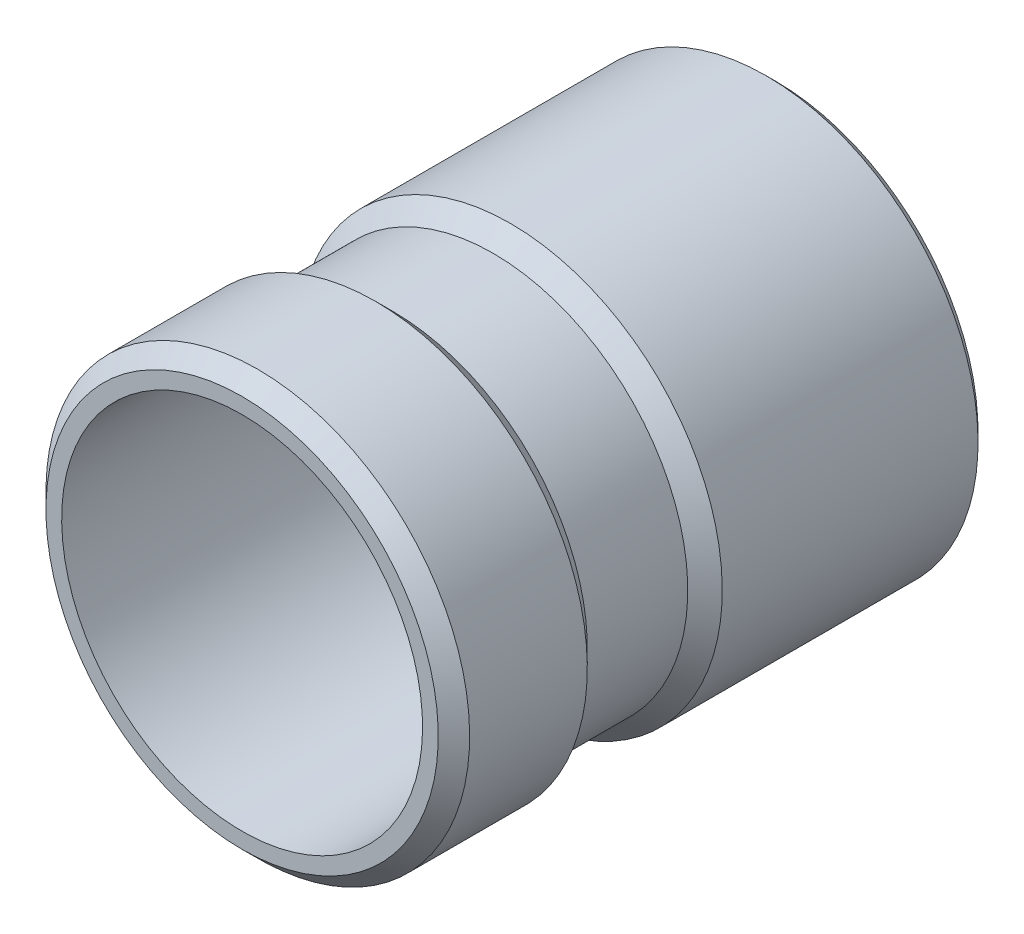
ISO-10303-21;
HEADER;
FILE_DESCRIPTION(('STEP AP214'),'2;1');
FILE_NAME('part.step','',(''),(''),'','','');
FILE_SCHEMA(('AUTOMOTIVE_DESIGN { 1 0 10303 214 1 1 1 1 }'));
ENDSEC;
DATA;
#1=APPLICATION_CONTEXT('core data for automotive mechanical design processes');
#2=APPLICATION_PROTOCOL_DEFINITION('international standard','automotive_design',2000,#1);
#3=PRODUCT_CONTEXT('',#1,'mechanical');
#4=PRODUCT('Part','Part','',(#3));
#5=PRODUCT_RELATED_PRODUCT_CATEGORY('part','',(#4));
#6=PRODUCT_DEFINITION_FORMATION('','',#4);
#7=PRODUCT_DEFINITION_CONTEXT('part definition',#1,'design');
#8=PRODUCT_DEFINITION('design','',#6,#7);
#9=PRODUCT_DEFINITION_SHAPE('','',#8);
#10=(LENGTH_UNIT() NAMED_UNIT(*) SI_UNIT(.MILLI.,.METRE.));
#11=(NAMED_UNIT(*) PLANE_ANGLE_UNIT() SI_UNIT($,.RADIAN.));
#12=(NAMED_UNIT(*) SI_UNIT($,.STERADIAN.) SOLID_ANGLE_UNIT());
#13=UNCERTAINTY_MEASURE_WITH_UNIT(LENGTH_MEASURE(1.E-05),#10,'distance_accuracy_value','');
#14=(GEOMETRIC_REPRESENTATION_CONTEXT(3) GLOBAL_UNCERTAINTY_ASSIGNED_CONTEXT((#13)) GLOBAL_UNIT_ASSIGNED_CONTEXT((#10,
#11,#12)) REPRESENTATION_CONTEXT('',''));
#15=CARTESIAN_POINT('',(0.,0.,0.));
#16=DIRECTION('',(0.,0.,1.));
#17=DIRECTION('',(1.,0.,0.));
#18=AXIS2_PLACEMENT_3D('',#15,#16,#17);
#19=CARTESIAN_POINT('',(0.,0.,0.));
#20=DIRECTION('',(0.,0.,-1.));
#21=DIRECTION('',(0.,1.,0.));
#22=AXIS2_PLACEMENT_3D('',#19,#20,#21);
#23=CYLINDRICAL_SURFACE('',#22,5.75);
#24=CARTESIAN_POINT('',(0.,0.,17.));
#25=DIRECTION('',(0.,0.,-1.));
#26=DIRECTION('',(0.,1.,0.));
#27=AXIS2_PLACEMENT_3D('',#24,#25,#26);
#28=CIRCLE('',#27,5.75);
#29=CARTESIAN_POINT('',(0.,5.75,17.));
#30=VERTEX_POINT('',#29);
#31=EDGE_CURVE('E44',#30,#30,#28,.T.);
#32=ORIENTED_EDGE('',*,*,#31,.F.);
#33=EDGE_LOOP('',(#32));
#34=FACE_BOUND('',#33,.T.);
#35=CARTESIAN_POINT('',(0.,0.,0.));
#36=DIRECTION('',(0.,0.,-1.));
#37=DIRECTION('',(0.,1.,0.));
#38=AXIS2_PLACEMENT_3D('',#35,#36,#37);
#39=CIRCLE('',#38,5.75);
#40=CARTESIAN_POINT('',(0.,5.75,0.));
#41=VERTEX_POINT('',#40);
#42=EDGE_CURVE('E47',#41,#41,#39,.T.);
#43=ORIENTED_EDGE('',*,*,#42,.T.);
#44=EDGE_LOOP('',(#43));
#45=FACE_BOUND('',#44,.T.);
#46=ADVANCED_FACE('F12',(#34,#45),#23,.F.);
#47=CARTESIAN_POINT('',(6.25,0.,17.));
#48=DIRECTION('',(0.,0.,1.));
#49=DIRECTION('',(0.,-1.,0.));
#50=AXIS2_PLACEMENT_3D('',#47,#48,#49);
#51=PLANE('',#50);
#52=ORIENTED_EDGE('',*,*,#31,.T.);
#53=EDGE_LOOP('',(#52));
#54=FACE_BOUND('',#53,.T.);
#55=CARTESIAN_POINT('',(0.,0.,17.));
#56=DIRECTION('',(0.,0.,-1.));
#57=DIRECTION('',(0.,1.,0.));
#58=AXIS2_PLACEMENT_3D('',#55,#56,#57);
#59=CIRCLE('',#58,6.25);
#60=CARTESIAN_POINT('',(0.,6.25,17.));
#61=VERTEX_POINT('',#60);
#62=EDGE_CURVE('E41',#61,#61,#59,.T.);
#63=ORIENTED_EDGE('',*,*,#62,.F.);
#64=EDGE_LOOP('',(#63));
#65=FACE_BOUND('',#64,.T.);
#66=ADVANCED_FACE('F61',(#54,#65),#51,.T.);
#67=CARTESIAN_POINT('',(0.,0.,16.5));
#68=DIRECTION('',(0.,0.,-1.));
#69=DIRECTION('',(0.,1.,0.));
#70=AXIS2_PLACEMENT_3D('',#67,#68,#69);
#71=CONICAL_SURFACE('',#70,6.75,0.785398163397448);
#72=ORIENTED_EDGE('',*,*,#62,.T.);
#73=EDGE_LOOP('',(#72));
#74=FACE_BOUND('',#73,.T.);
#75=CARTESIAN_POINT('',(0.,0.,16.5));
#76=DIRECTION('',(0.,0.,-1.));
#77=DIRECTION('',(0.,1.,0.));
#78=AXIS2_PLACEMENT_3D('',#75,#76,#77);
#79=CIRCLE('',#78,6.75);
#80=CARTESIAN_POINT('',(0.,6.75,16.5));
#81=VERTEX_POINT('',#80);
#82=EDGE_CURVE('E38',#81,#81,#79,.T.);
#83=ORIENTED_EDGE('',*,*,#82,.F.);
#84=EDGE_LOOP('',(#83));
#85=FACE_BOUND('',#84,.T.);
#86=ADVANCED_FACE('F68',(#74,#85),#71,.T.);
#87=CARTESIAN_POINT('',(0.,0.,0.));
#88=DIRECTION('',(0.,0.,-1.));
#89=DIRECTION('',(0.,1.,0.));
#90=AXIS2_PLACEMENT_3D('',#87,#88,#89);
#91=CYLINDRICAL_SURFACE('',#90,6.75);
#92=ORIENTED_EDGE('',*,*,#82,.T.);
#93=EDGE_LOOP('',(#92));
#94=FACE_BOUND('',#93,.T.);
#95=CARTESIAN_POINT('',(0.,0.,12.75));
#96=DIRECTION('',(0.,0.,-1.));
#97=DIRECTION('',(0.,1.,0.));
#98=AXIS2_PLACEMENT_3D('',#95,#96,#97);
#99=CIRCLE('',#98,6.75);
#100=CARTESIAN_POINT('',(0.,6.75,12.75));
#101=VERTEX_POINT('',#100);
#102=EDGE_CURVE('E35',#101,#101,#99,.T.);
#103=ORIENTED_EDGE('',*,*,#102,.F.);
#104=EDGE_LOOP('',(#103));
#105=FACE_BOUND('',#104,.T.);
#106=ADVANCED_FACE('F75',(#94,#105),#91,.T.);
#107=CARTESIAN_POINT('',(0.,0.,12.2));
#108=DIRECTION('',(0.,0.,1.));
#109=DIRECTION('',(0.,-1.,0.));
#110=AXIS2_PLACEMENT_3D('',#107,#108,#109);
#111=CONICAL_SURFACE('',#110,6.2,0.785398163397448);
#112=ORIENTED_EDGE('',*,*,#102,.T.);
#113=EDGE_LOOP('',(#112));
#114=FACE_BOUND('',#113,.T.);
#115=CARTESIAN_POINT('',(0.,0.,12.2));
#116=DIRECTION('',(0.,0.,-1.));
#117=DIRECTION('',(0.,1.,0.));
#118=AXIS2_PLACEMENT_3D('',#115,#116,#117);
#119=CIRCLE('',#118,6.2);
#120=CARTESIAN_POINT('',(0.,6.2,12.2));
#121=VERTEX_POINT('',#120);
#122=EDGE_CURVE('E32',#121,#121,#119,.T.);
#123=ORIENTED_EDGE('',*,*,#122,.F.);
#124=EDGE_LOOP('',(#123));
#125=FACE_BOUND('',#124,.T.);
#126=ADVANCED_FACE('F79',(#114,#125),#111,.T.);
#127=CARTESIAN_POINT('',(0.,0.,0.));
#128=DIRECTION('',(0.,0.,-1.));
#129=DIRECTION('',(0.,1.,0.));
#130=AXIS2_PLACEMENT_3D('',#127,#128,#129);
#131=CYLINDRICAL_SURFACE('',#130,6.2);
#132=ORIENTED_EDGE('',*,*,#122,.T.);
#133=EDGE_LOOP('',(#132));
#134=FACE_BOUND('',#133,.T.);
#135=CARTESIAN_POINT('',(0.,0.,9.));
#136=DIRECTION('',(0.,0.,-1.));
#137=DIRECTION('',(0.,1.,0.));
#138=AXIS2_PLACEMENT_3D('',#135,#136,#137);
#139=CIRCLE('',#138,6.2);
#140=CARTESIAN_POINT('',(0.,6.2,9.));
#141=VERTEX_POINT('',#140);
#142=EDGE_CURVE('E27',#141,#141,#139,.T.);
#143=ORIENTED_EDGE('',*,*,#142,.F.);
#144=EDGE_LOOP('',(#143));
#145=FACE_BOUND('',#144,.T.);
#146=ADVANCED_FACE('F83',(#134,#145),#131,.T.);
#147=CARTESIAN_POINT('',(0.,0.,8.45));
#148=DIRECTION('',(0.,0.,-1.));
#149=DIRECTION('',(0.,1.,0.));
#150=AXIS2_PLACEMENT_3D('',#147,#148,#149);
#151=CONICAL_SURFACE('',#150,6.75,0.785398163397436);
#152=ORIENTED_EDGE('',*,*,#142,.T.);
#153=EDGE_LOOP('',(#152));
#154=FACE_BOUND('',#153,.T.);
#155=CARTESIAN_POINT('',(0.,0.,8.45));
#156=DIRECTION('',(0.,0.,-1.));
#157=DIRECTION('',(0.,1.,0.));
#158=AXIS2_PLACEMENT_3D('',#155,#156,#157);
#159=CIRCLE('',#158,6.75);
#160=CARTESIAN_POINT('',(0.,6.75,8.45));
#161=VERTEX_POINT('',#160);
#162=EDGE_CURVE('E23',#161,#161,#159,.T.);
#163=ORIENTED_EDGE('',*,*,#162,.F.);
#164=EDGE_LOOP('',(#163));
#165=FACE_BOUND('',#164,.T.);
#166=ADVANCED_FACE('F87',(#154,#165),#151,.T.);
#167=CARTESIAN_POINT('',(0.,0.,0.));
#168=DIRECTION('',(0.,0.,-1.));
#169=DIRECTION('',(0.,1.,0.));
#170=AXIS2_PLACEMENT_3D('',#167,#168,#169);
#171=CYLINDRICAL_SURFACE('',#170,6.75);
#172=ORIENTED_EDGE('',*,*,#162,.T.);
#173=EDGE_LOOP('',(#172));
#174=FACE_BOUND('',#173,.T.);
#175=CARTESIAN_POINT('',(0.,0.,0.299999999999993));
#176=DIRECTION('',(0.,0.,-1.));
#177=DIRECTION('',(0.,1.,0.));
#178=AXIS2_PLACEMENT_3D('',#175,#176,#177);
#179=CIRCLE('',#178,6.75);
#180=CARTESIAN_POINT('',(0.,6.75,0.299999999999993));
#181=VERTEX_POINT('',#180);
#182=EDGE_CURVE('E19',#181,#181,#179,.T.);
#183=ORIENTED_EDGE('',*,*,#182,.F.);
#184=EDGE_LOOP('',(#183));
#185=FACE_BOUND('',#184,.T.);
#186=ADVANCED_FACE('F59',(#174,#185),#171,.T.);
#187=CARTESIAN_POINT('',(0.,0.,0.));
#188=DIRECTION('',(0.,0.,1.));
#189=DIRECTION('',(0.,-1.,0.));
#190=AXIS2_PLACEMENT_3D('',#187,#188,#189);
#191=CONICAL_SURFACE('',#190,6.45,0.785398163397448);
#192=ORIENTED_EDGE('',*,*,#182,.T.);
#193=EDGE_LOOP('',(#192));
#194=FACE_BOUND('',#193,.T.);
#195=CARTESIAN_POINT('',(0.,0.,0.));
#196=DIRECTION('',(0.,0.,-1.));
#197=DIRECTION('',(0.,1.,0.));
#198=AXIS2_PLACEMENT_3D('',#195,#196,#197);
#199=CIRCLE('',#198,6.45);
#200=CARTESIAN_POINT('',(0.,6.45,0.));
#201=VERTEX_POINT('',#200);
#202=EDGE_CURVE('E8',#201,#201,#199,.T.);
#203=ORIENTED_EDGE('',*,*,#202,.F.);
#204=EDGE_LOOP('',(#203));
#205=FACE_BOUND('',#204,.T.);
#206=ADVANCED_FACE('F53',(#194,#205),#191,.T.);
#207=CARTESIAN_POINT('',(5.75,0.,0.));
#208=DIRECTION('',(0.,0.,-1.));
#209=DIRECTION('',(0.,1.,0.));
#210=AXIS2_PLACEMENT_3D('',#207,#208,#209);
#211=PLANE('',#210);
#212=ORIENTED_EDGE('',*,*,#202,.T.);
#213=EDGE_LOOP('',(#212));
#214=FACE_BOUND('',#213,.T.);
#215=ORIENTED_EDGE('',*,*,#42,.F.);
#216=EDGE_LOOP('',(#215));
#217=FACE_BOUND('',#216,.T.);
#218=ADVANCED_FACE('F14',(#214,#217),#211,.T.);
#219=CLOSED_SHELL('',(#46,#66,#86,#106,#126,#146,#166,#186,#206,#218));
#220=MANIFOLD_SOLID_BREP('B1',#219);
#221=ADVANCED_BREP_SHAPE_REPRESENTATION('',(#18,#220),#14);
#222=SHAPE_DEFINITION_REPRESENTATION(#9,#221);
ENDSEC;
END-ISO-10303-21;
